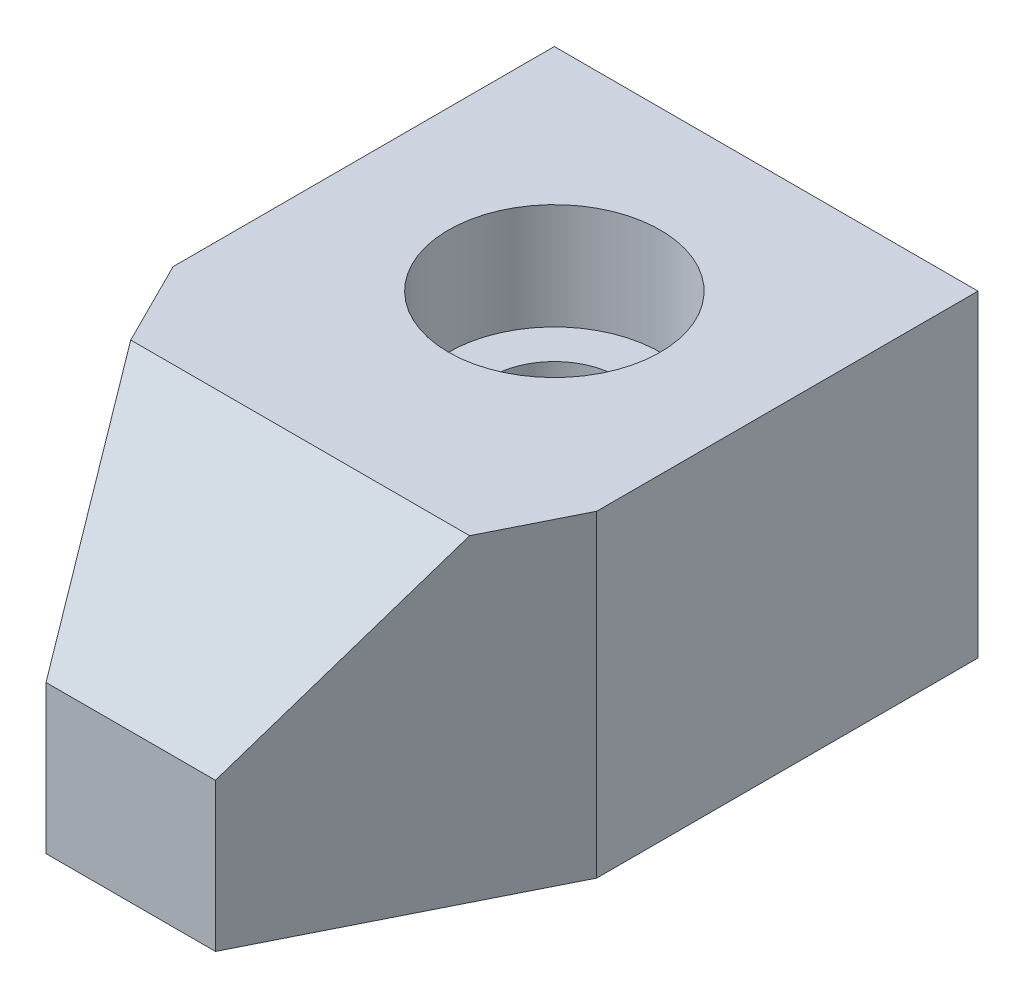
ISO-10303-21;
HEADER;
FILE_DESCRIPTION(('STEP AP214'),'2;1');
FILE_NAME('part.step','',(''),(''),'','','');
FILE_SCHEMA(('AUTOMOTIVE_DESIGN { 1 0 10303 214 1 1 1 1 }'));
ENDSEC;
DATA;
#1=APPLICATION_CONTEXT('core data for automotive mechanical design processes');
#2=APPLICATION_PROTOCOL_DEFINITION('international standard','automotive_design',2000,#1);
#3=PRODUCT_CONTEXT('',#1,'mechanical');
#4=PRODUCT('Part','Part','',(#3));
#5=PRODUCT_RELATED_PRODUCT_CATEGORY('part','',(#4));
#6=PRODUCT_DEFINITION_FORMATION('','',#4);
#7=PRODUCT_DEFINITION_CONTEXT('part definition',#1,'design');
#8=PRODUCT_DEFINITION('design','',#6,#7);
#9=PRODUCT_DEFINITION_SHAPE('','',#8);
#10=(LENGTH_UNIT() NAMED_UNIT(*) SI_UNIT(.MILLI.,.METRE.));
#11=(NAMED_UNIT(*) PLANE_ANGLE_UNIT() SI_UNIT($,.RADIAN.));
#12=(NAMED_UNIT(*) SI_UNIT($,.STERADIAN.) SOLID_ANGLE_UNIT());
#13=UNCERTAINTY_MEASURE_WITH_UNIT(LENGTH_MEASURE(1.E-05),#10,'distance_accuracy_value','');
#14=(GEOMETRIC_REPRESENTATION_CONTEXT(3) GLOBAL_UNCERTAINTY_ASSIGNED_CONTEXT((#13)) GLOBAL_UNIT_ASSIGNED_CONTEXT((#10,
#11,#12)) REPRESENTATION_CONTEXT('',''));
#15=CARTESIAN_POINT('',(0.,0.,0.));
#16=DIRECTION('',(0.,0.,1.));
#17=DIRECTION('',(1.,0.,0.));
#18=AXIS2_PLACEMENT_3D('',#15,#16,#17);
#19=CARTESIAN_POINT('',(20.,-7.5,-15.));
#20=DIRECTION('',(0.,0.,1.));
#21=DIRECTION('',(1.,0.,0.));
#22=AXIS2_PLACEMENT_3D('',#19,#20,#21);
#23=PLANE('',#22);
#24=DIRECTION('',(0.,1.,0.));
#25=VECTOR('',#24,1.);
#26=CARTESIAN_POINT('',(0.,-7.5,-15.));
#27=LINE('',#26,#25);
#28=CARTESIAN_POINT('',(0.,-7.5,-15.));
#29=VERTEX_POINT('',#28);
#30=CARTESIAN_POINT('',(0.,7.5,-15.));
#31=VERTEX_POINT('',#30);
#32=EDGE_CURVE('E142',#29,#31,#27,.T.);
#33=ORIENTED_EDGE('',*,*,#32,.T.);
#34=DIRECTION('',(-1.,0.,0.));
#35=VECTOR('',#34,1.);
#36=CARTESIAN_POINT('',(20.,7.5,-15.));
#37=LINE('',#36,#35);
#38=CARTESIAN_POINT('',(20.,7.5,-15.));
#39=VERTEX_POINT('',#38);
#40=EDGE_CURVE('E109',#39,#31,#37,.T.);
#41=ORIENTED_EDGE('',*,*,#40,.F.);
#42=DIRECTION('',(0.,1.,0.));
#43=VECTOR('',#42,1.);
#44=CARTESIAN_POINT('',(20.,-7.5,-15.));
#45=LINE('',#44,#43);
#46=CARTESIAN_POINT('',(20.,-7.5,-15.));
#47=VERTEX_POINT('',#46);
#48=EDGE_CURVE('E143',#47,#39,#45,.T.);
#49=ORIENTED_EDGE('',*,*,#48,.F.);
#50=DIRECTION('',(-1.,0.,0.));
#51=VECTOR('',#50,1.);
#52=CARTESIAN_POINT('',(20.,-7.5,-15.));
#53=LINE('',#52,#51);
#54=EDGE_CURVE('E110',#47,#29,#53,.T.);
#55=ORIENTED_EDGE('',*,*,#54,.T.);
#56=EDGE_LOOP('',(#33,#41,#49,#55));
#57=FACE_BOUND('',#56,.T.);
#58=ADVANCED_FACE('F33',(#57),#23,.F.);
#59=CARTESIAN_POINT('',(20.,7.5,15.));
#60=DIRECTION('',(0.,-1.,0.));
#61=DIRECTION('',(0.,0.,-1.));
#62=AXIS2_PLACEMENT_3D('',#59,#60,#61);
#63=PLANE('',#62);
#64=CARTESIAN_POINT('',(10.,7.5,-5.));
#65=DIRECTION('',(0.,1.,0.));
#66=DIRECTION('',(0.,0.,1.));
#67=AXIS2_PLACEMENT_3D('',#64,#65,#66);
#68=CIRCLE('',#67,5.);
#69=CARTESIAN_POINT('',(10.,7.5,0.));
#70=VERTEX_POINT('',#69);
#71=EDGE_CURVE('E126',#70,#70,#68,.T.);
#72=ORIENTED_EDGE('',*,*,#71,.F.);
#73=EDGE_LOOP('',(#72));
#74=FACE_BOUND('',#73,.T.);
#75=DIRECTION('',(1.,0.,0.));
#76=VECTOR('',#75,1.);
#77=CARTESIAN_POINT('',(0.,7.5,7.));
#78=LINE('',#77,#76);
#79=CARTESIAN_POINT('',(2.,7.5,7.));
#80=VERTEX_POINT('',#79);
#81=CARTESIAN_POINT('',(18.,7.5,7.));
#82=VERTEX_POINT('',#81);
#83=EDGE_CURVE('E122',#80,#82,#78,.T.);
#84=ORIENTED_EDGE('',*,*,#83,.T.);
#85=DIRECTION('',(0.447213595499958,0.,-0.894427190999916));
#86=VECTOR('',#85,1.);
#87=CARTESIAN_POINT('',(15.2,7.5,12.6));
#88=LINE('',#87,#86);
#89=CARTESIAN_POINT('',(20.,7.5,3.));
#90=VERTEX_POINT('',#89);
#91=EDGE_CURVE('E47',#82,#90,#88,.T.);
#92=ORIENTED_EDGE('',*,*,#91,.T.);
#93=DIRECTION('',(0.,0.,1.));
#94=VECTOR('',#93,1.);
#95=CARTESIAN_POINT('',(20.,7.5,15.));
#96=LINE('',#95,#94);
#97=EDGE_CURVE('E146',#39,#90,#96,.T.);
#98=ORIENTED_EDGE('',*,*,#97,.F.);
#99=ORIENTED_EDGE('',*,*,#40,.T.);
#100=DIRECTION('',(0.,0.,1.));
#101=VECTOR('',#100,1.);
#102=CARTESIAN_POINT('',(0.,7.5,15.));
#103=LINE('',#102,#101);
#104=CARTESIAN_POINT('',(0.,7.5,3.));
#105=VERTEX_POINT('',#104);
#106=EDGE_CURVE('E153',#31,#105,#103,.T.);
#107=ORIENTED_EDGE('',*,*,#106,.T.);
#108=DIRECTION('',(0.447213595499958,0.,0.894427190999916));
#109=VECTOR('',#108,1.);
#110=CARTESIAN_POINT('',(8.8,7.5,20.6));
#111=LINE('',#110,#109);
#112=EDGE_CURVE('E128',#105,#80,#111,.T.);
#113=ORIENTED_EDGE('',*,*,#112,.T.);
#114=EDGE_LOOP('',(#84,#92,#98,#99,#107,#113));
#115=FACE_BOUND('',#114,.T.);
#116=ADVANCED_FACE('F165',(#74,#115),#63,.F.);
#117=CARTESIAN_POINT('',(20.,-7.5,15.));
#118=DIRECTION('',(0.,0.,-1.));
#119=DIRECTION('',(-1.,0.,0.));
#120=AXIS2_PLACEMENT_3D('',#117,#118,#119);
#121=PLANE('',#120);
#122=DIRECTION('',(-1.,0.,0.));
#123=VECTOR('',#122,1.);
#124=CARTESIAN_POINT('',(20.,-7.5,15.));
#125=LINE('',#124,#123);
#126=CARTESIAN_POINT('',(14.,-7.5,15.));
#127=VERTEX_POINT('',#126);
#128=CARTESIAN_POINT('',(6.,-7.5,15.));
#129=VERTEX_POINT('',#128);
#130=EDGE_CURVE('E104',#127,#129,#125,.T.);
#131=ORIENTED_EDGE('',*,*,#130,.F.);
#132=DIRECTION('',(0.,1.,0.));
#133=VECTOR('',#132,1.);
#134=CARTESIAN_POINT('',(14.,-10.,15.));
#135=LINE('',#134,#133);
#136=CARTESIAN_POINT('',(14.,-0.5,15.));
#137=VERTEX_POINT('',#136);
#138=EDGE_CURVE('E89',#127,#137,#135,.T.);
#139=ORIENTED_EDGE('',*,*,#138,.T.);
#140=DIRECTION('',(1.,0.,0.));
#141=VECTOR('',#140,1.);
#142=CARTESIAN_POINT('',(0.,-0.5,15.));
#143=LINE('',#142,#141);
#144=CARTESIAN_POINT('',(6.,-0.5,15.));
#145=VERTEX_POINT('',#144);
#146=EDGE_CURVE('E120',#145,#137,#143,.T.);
#147=ORIENTED_EDGE('',*,*,#146,.F.);
#148=DIRECTION('',(0.,1.,0.));
#149=VECTOR('',#148,1.);
#150=CARTESIAN_POINT('',(6.,-10.,15.));
#151=LINE('',#150,#149);
#152=EDGE_CURVE('E54',#129,#145,#151,.T.);
#153=ORIENTED_EDGE('',*,*,#152,.F.);
#154=EDGE_LOOP('',(#131,#139,#147,#153));
#155=FACE_BOUND('',#154,.T.);
#156=ADVANCED_FACE('F108',(#155),#121,.F.);
#157=CARTESIAN_POINT('',(20.,-7.5,15.));
#158=DIRECTION('',(0.,1.,0.));
#159=DIRECTION('',(0.,0.,1.));
#160=AXIS2_PLACEMENT_3D('',#157,#158,#159);
#161=PLANE('',#160);
#162=CARTESIAN_POINT('',(10.,-7.5,-5.));
#163=DIRECTION('',(0.,1.,0.));
#164=DIRECTION('',(0.,0.,1.));
#165=AXIS2_PLACEMENT_3D('',#162,#163,#164);
#166=CIRCLE('',#165,3.);
#167=CARTESIAN_POINT('',(10.,-7.5,-2.));
#168=VERTEX_POINT('',#167);
#169=EDGE_CURVE('E139',#168,#168,#166,.T.);
#170=ORIENTED_EDGE('',*,*,#169,.T.);
#171=EDGE_LOOP('',(#170));
#172=FACE_BOUND('',#171,.T.);
#173=DIRECTION('',(0.,0.,-1.));
#174=VECTOR('',#173,1.);
#175=CARTESIAN_POINT('',(20.,-7.5,15.));
#176=LINE('',#175,#174);
#177=CARTESIAN_POINT('',(20.,-7.5,3.));
#178=VERTEX_POINT('',#177);
#179=EDGE_CURVE('E106',#178,#47,#176,.T.);
#180=ORIENTED_EDGE('',*,*,#179,.F.);
#181=DIRECTION('',(-0.447213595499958,0.,0.894427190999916));
#182=VECTOR('',#181,1.);
#183=CARTESIAN_POINT('',(15.2,-7.5,12.6));
#184=LINE('',#183,#182);
#185=EDGE_CURVE('E92',#178,#127,#184,.T.);
#186=ORIENTED_EDGE('',*,*,#185,.T.);
#187=ORIENTED_EDGE('',*,*,#130,.T.);
#188=DIRECTION('',(-0.447213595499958,0.,-0.894427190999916));
#189=VECTOR('',#188,1.);
#190=CARTESIAN_POINT('',(8.8,-7.5,20.6));
#191=LINE('',#190,#189);
#192=CARTESIAN_POINT('',(0.,-7.5,3.));
#193=VERTEX_POINT('',#192);
#194=EDGE_CURVE('E124',#129,#193,#191,.T.);
#195=ORIENTED_EDGE('',*,*,#194,.T.);
#196=DIRECTION('',(0.,0.,-1.));
#197=VECTOR('',#196,1.);
#198=CARTESIAN_POINT('',(0.,-7.5,15.));
#199=LINE('',#198,#197);
#200=EDGE_CURVE('E147',#193,#29,#199,.T.);
#201=ORIENTED_EDGE('',*,*,#200,.T.);
#202=ORIENTED_EDGE('',*,*,#54,.F.);
#203=EDGE_LOOP('',(#180,#186,#187,#195,#201,#202));
#204=FACE_BOUND('',#203,.T.);
#205=ADVANCED_FACE('F102',(#172,#204),#161,.F.);
#206=CARTESIAN_POINT('',(20.,7.5,-15.));
#207=DIRECTION('',(-1.,0.,0.));
#208=DIRECTION('',(0.,0.,1.));
#209=AXIS2_PLACEMENT_3D('',#206,#207,#208);
#210=PLANE('',#209);
#211=ORIENTED_EDGE('',*,*,#97,.T.);
#212=DIRECTION('',(0.,1.,0.));
#213=VECTOR('',#212,1.);
#214=CARTESIAN_POINT('',(20.,-10.,3.));
#215=LINE('',#214,#213);
#216=EDGE_CURVE('E98',#178,#90,#215,.T.);
#217=ORIENTED_EDGE('',*,*,#216,.F.);
#218=ORIENTED_EDGE('',*,*,#179,.T.);
#219=ORIENTED_EDGE('',*,*,#48,.T.);
#220=EDGE_LOOP('',(#211,#217,#218,#219));
#221=FACE_BOUND('',#220,.T.);
#222=ADVANCED_FACE('F167',(#221),#210,.F.);
#223=CARTESIAN_POINT('',(0.,7.5,-15.));
#224=DIRECTION('',(-1.,0.,0.));
#225=DIRECTION('',(0.,0.,1.));
#226=AXIS2_PLACEMENT_3D('',#223,#224,#225);
#227=PLANE('',#226);
#228=DIRECTION('',(0.,1.,0.));
#229=VECTOR('',#228,1.);
#230=CARTESIAN_POINT('',(0.,-10.,3.));
#231=LINE('',#230,#229);
#232=EDGE_CURVE('E163',#193,#105,#231,.T.);
#233=ORIENTED_EDGE('',*,*,#232,.T.);
#234=ORIENTED_EDGE('',*,*,#106,.F.);
#235=ORIENTED_EDGE('',*,*,#32,.F.);
#236=ORIENTED_EDGE('',*,*,#200,.F.);
#237=EDGE_LOOP('',(#233,#234,#235,#236));
#238=FACE_BOUND('',#237,.T.);
#239=ADVANCED_FACE('F162',(#238),#227,.T.);
#240=CARTESIAN_POINT('',(10.,10.1510574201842,-5.));
#241=DIRECTION('',(0.,1.,0.));
#242=DIRECTION('',(0.,0.,1.));
#243=AXIS2_PLACEMENT_3D('',#240,#241,#242);
#244=CYLINDRICAL_SURFACE('',#243,3.);
#245=ORIENTED_EDGE('',*,*,#169,.F.);
#246=EDGE_LOOP('',(#245));
#247=FACE_BOUND('',#246,.T.);
#248=CARTESIAN_POINT('',(10.,2.5,-5.));
#249=DIRECTION('',(0.,1.,0.));
#250=DIRECTION('',(0.,0.,1.));
#251=AXIS2_PLACEMENT_3D('',#248,#249,#250);
#252=CIRCLE('',#251,3.);
#253=CARTESIAN_POINT('',(10.,2.5,-2.));
#254=VERTEX_POINT('',#253);
#255=EDGE_CURVE('E136',#254,#254,#252,.T.);
#256=ORIENTED_EDGE('',*,*,#255,.T.);
#257=EDGE_LOOP('',(#256));
#258=FACE_BOUND('',#257,.T.);
#259=ADVANCED_FACE('F199',(#247,#258),#244,.F.);
#260=CARTESIAN_POINT('',(10.,2.5,0.));
#261=DIRECTION('',(0.,-1.,0.));
#262=DIRECTION('',(0.,0.,-1.));
#263=AXIS2_PLACEMENT_3D('',#260,#261,#262);
#264=PLANE('',#263);
#265=ORIENTED_EDGE('',*,*,#255,.F.);
#266=EDGE_LOOP('',(#265));
#267=FACE_BOUND('',#266,.T.);
#268=CARTESIAN_POINT('',(10.,2.5,-5.));
#269=DIRECTION('',(0.,1.,0.));
#270=DIRECTION('',(0.,0.,1.));
#271=AXIS2_PLACEMENT_3D('',#268,#269,#270);
#272=CIRCLE('',#271,5.);
#273=CARTESIAN_POINT('',(10.,2.5,0.));
#274=VERTEX_POINT('',#273);
#275=EDGE_CURVE('E133',#274,#274,#272,.T.);
#276=ORIENTED_EDGE('',*,*,#275,.T.);
#277=EDGE_LOOP('',(#276));
#278=FACE_BOUND('',#277,.T.);
#279=ADVANCED_FACE('F204',(#267,#278),#264,.F.);
#280=CARTESIAN_POINT('',(10.,10.1510574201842,-5.));
#281=DIRECTION('',(0.,1.,0.));
#282=DIRECTION('',(0.,0.,1.));
#283=AXIS2_PLACEMENT_3D('',#280,#281,#282);
#284=CYLINDRICAL_SURFACE('',#283,5.);
#285=ORIENTED_EDGE('',*,*,#275,.F.);
#286=EDGE_LOOP('',(#285));
#287=FACE_BOUND('',#286,.T.);
#288=ORIENTED_EDGE('',*,*,#71,.T.);
#289=EDGE_LOOP('',(#288));
#290=FACE_BOUND('',#289,.T.);
#291=ADVANCED_FACE('F181',(#287,#290),#284,.F.);
#292=CARTESIAN_POINT('',(0.,-0.5,15.));
#293=DIRECTION('',(0.,-0.707106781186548,-0.707106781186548));
#294=DIRECTION('',(0.,0.707106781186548,-0.707106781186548));
#295=AXIS2_PLACEMENT_3D('',#292,#293,#294);
#296=PLANE('',#295);
#297=ORIENTED_EDGE('',*,*,#146,.T.);
#298=DIRECTION('',(0.333333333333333,0.666666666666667,-0.666666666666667));
#299=VECTOR('',#298,1.);
#300=CARTESIAN_POINT('',(12.4444444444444,-3.61111111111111,18.1111111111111));
#301=LINE('',#300,#299);
#302=EDGE_CURVE('E11',#137,#82,#301,.T.);
#303=ORIENTED_EDGE('',*,*,#302,.T.);
#304=ORIENTED_EDGE('',*,*,#83,.F.);
#305=DIRECTION('',(0.333333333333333,-0.666666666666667,0.666666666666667));
#306=VECTOR('',#305,1.);
#307=CARTESIAN_POINT('',(5.33333333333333,0.833333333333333,13.6666666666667));
#308=LINE('',#307,#306);
#309=EDGE_CURVE('E40',#80,#145,#308,.T.);
#310=ORIENTED_EDGE('',*,*,#309,.T.);
#311=EDGE_LOOP('',(#297,#303,#304,#310));
#312=FACE_BOUND('',#311,.T.);
#313=ADVANCED_FACE('F119',(#312),#296,.F.);
#314=CARTESIAN_POINT('',(0.,-10.,3.));
#315=DIRECTION('',(0.894427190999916,0.,-0.447213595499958));
#316=DIRECTION('',(-0.447213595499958,0.,-0.894427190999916));
#317=AXIS2_PLACEMENT_3D('',#314,#315,#316);
#318=PLANE('',#317);
#319=ORIENTED_EDGE('',*,*,#152,.T.);
#320=ORIENTED_EDGE('',*,*,#309,.F.);
#321=ORIENTED_EDGE('',*,*,#112,.F.);
#322=ORIENTED_EDGE('',*,*,#232,.F.);
#323=ORIENTED_EDGE('',*,*,#194,.F.);
#324=EDGE_LOOP('',(#319,#320,#321,#322,#323));
#325=FACE_BOUND('',#324,.T.);
#326=ADVANCED_FACE('F173',(#325),#318,.F.);
#327=CARTESIAN_POINT('',(20.,-10.,3.));
#328=DIRECTION('',(-0.894427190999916,0.,-0.447213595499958));
#329=DIRECTION('',(-0.447213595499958,0.,0.894427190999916));
#330=AXIS2_PLACEMENT_3D('',#327,#328,#329);
#331=PLANE('',#330);
#332=ORIENTED_EDGE('',*,*,#216,.T.);
#333=ORIENTED_EDGE('',*,*,#91,.F.);
#334=ORIENTED_EDGE('',*,*,#302,.F.);
#335=ORIENTED_EDGE('',*,*,#138,.F.);
#336=ORIENTED_EDGE('',*,*,#185,.F.);
#337=EDGE_LOOP('',(#332,#333,#334,#335,#336));
#338=FACE_BOUND('',#337,.T.);
#339=ADVANCED_FACE('F91',(#338),#331,.F.);
#340=CLOSED_SHELL('',(#58,#116,#156,#205,#222,#239,#259,#279,#291,#313,#326,#339));
#341=MANIFOLD_SOLID_BREP('B2',#340);
#342=ADVANCED_BREP_SHAPE_REPRESENTATION('',(#18,#341),#14);
#343=SHAPE_DEFINITION_REPRESENTATION(#9,#342);
ENDSEC;
END-ISO-10303-21;
